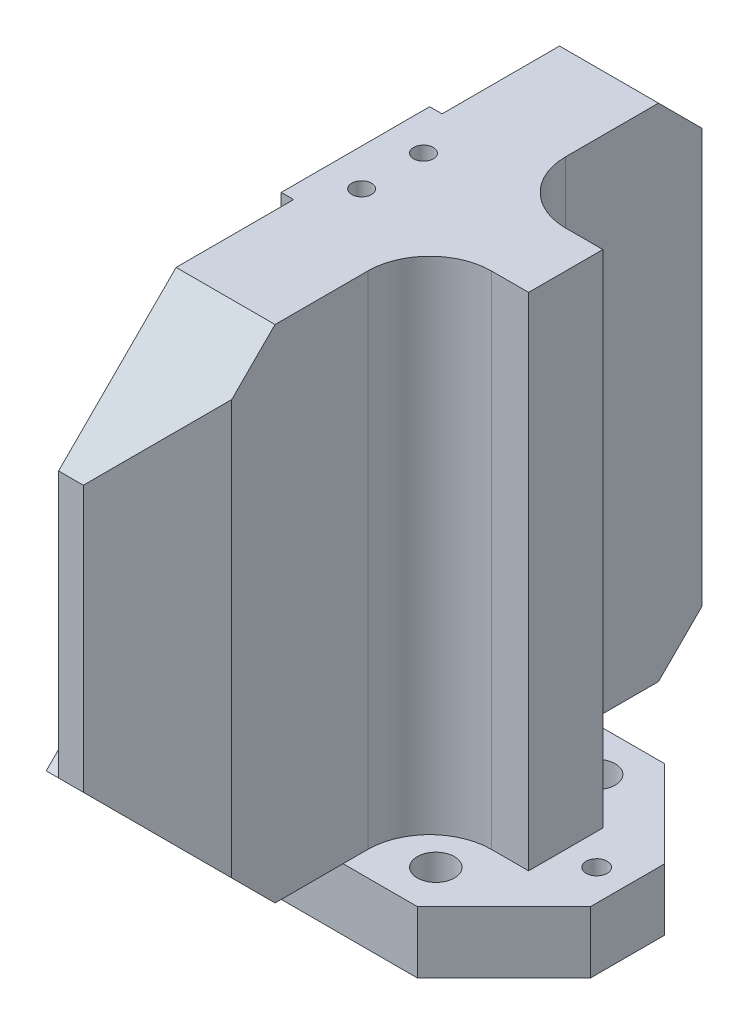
from build123d import *

# Parameters (mm, degrees)
SKETCH_1_W                  = 50
SKETCH_1_H                  = 40
EXTRUDE_1_DEPTH             = 8
CHAMFER_1_SIZE              = 9.5
SKETCH_2_W                  = 40
SKETCH_2_H                  = 20
EXTRUDE_2_DEPTH             = 5
SKETCH_3_W                  = 8
SKETCH_3_H                  = 6
EXTRUDE_3_DEPTH             = 40
FILLET_1_R                  = 5
CHAMFER_2_SIZE              = 8
EXTRUDE_4_DEPTH             = 1
SKETCH_5_W                  = 12
SKETCH_5_H                  = 7
EXTRUDE_5_DEPTH             = 1
FILLET_2_R                  = 10
CHAMFER_3_SIZE              = 6
SKETCH_6_R                  = 0.5
CUT_EXTRUDE_1_DEPTH         = 5
HOLE_WIZARD_M21_D           = 1.6
HOLE_WIZARD_M21_DEPTH       = 6
HOLE_WIZARD_M21_TIP         = 0.480688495
SKETCH_9_R                  = 0.5
CUT_EXTRUDE_2_DEPTH         = 5
HOLE_WIZARD_M22_D           = 1.6
HOLE_WIZARD_M22_DEPTH       = 6
HOLE_WIZARD_M22_CSINK_D     = 2.05
HOLE_WIZARD_M22_CSINK_ANGLE = 90
HOLE_WIZARD_M22_TIP         = 0.480688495
SKETCH_12_R                 = 0.5
CUT_EXTRUDE_3_DEPTH         = 5
HOLE_WIZARD_M23_D           = 1.6
HOLE_WIZARD_M23_DEPTH       = 6
HOLE_WIZARD_M23_CSINK_D     = 2.05
HOLE_WIZARD_M23_CSINK_ANGLE = 90
HOLE_WIZARD_M23_TIP         = 0.480688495
SKETCH_15_R                 = 9.863116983
CUT_EXTRUDE_4_DEPTH         = 2
SKETCH_16_R                 = 12.5
CUT_EXTRUDE_5_DEPTH         = 3
CHAMFER_4_SIZE              = 3
SKETCH_17_R                 = 0.85
CUT_EXTRUDE_6_DEPTH         = 52.77383384
SKETCH_18_R                 = 1.5
CUT_EXTRUDE_7_DEPTH         = 52.77383384
EXTRUDE_6_DEPTH             = 5
SKETCH_20_W                 = 6.646739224
SKETCH_20_H                 = 18.762407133
SKETCH_20_W_2               = 8.959731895
SKETCH_20_H_2               = 13.769202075
CUT_EXTRUDE_8_DEPTH         = 10
SKETCH_21_R                 = 25.12601308
CUT_EXTRUDE_9_DEPTH         = 0.34
CHAMFER_5_SIZE              = 7
SKETCH_22_R                 = 2
CUT_EXTRUDE_10_DEPTH        = 52.634602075
SKETCH_23_R                 = 0.8
EXTRUDE_7_DEPTH             = 0.5
CHAMFER_6_SIZE              = 9.5


with BuildPart() as part:
    # Sketch 1 → Extrude 1 (new body)
    with BuildSketch(Plane(origin=(0, 0, 0), x_dir=(0, 0, -1), z_dir=(1, 0, 0))):
        Rectangle(SKETCH_1_W, SKETCH_1_H)
    extrude(amount=EXTRUDE_1_DEPTH)

    # Chamfer 1
    chamfer_1_edges = [part.edges().sort_by_distance(p)[0] for p in [
        (4, -20, -25),
        (4, -20, 25),
    ]]
    chamfer(chamfer_1_edges, length=CHAMFER_1_SIZE)

    # Sketch 2 → Extrude 2 (add)
    with BuildSketch(Plane(origin=(0, -20, 0), x_dir=(-1, 0, 0), z_dir=(0, -1, 0))):
        with Locations((-5, 0)):
            Rectangle(SKETCH_2_W, SKETCH_2_H)
    extrude(amount=EXTRUDE_2_DEPTH)

    # Sketch 3 → Extrude 3 (add)
    with BuildSketch(Plane(origin=(0, -20, 0), x_dir=(1, 0, 0), z_dir=(0, 1, 0))):
        with Locations((12, 0)):
            Rectangle(SKETCH_3_W, SKETCH_3_H)
    extrude(amount=EXTRUDE_3_DEPTH)

    # Fillet 1
    fillet_1_edges = [part.edges().sort_by_distance(p)[0] for p in [
        (8, 0, 3),
        (8, 0, -3),
    ]]
    fillet(fillet_1_edges, radius=FILLET_1_R)

    # Chamfer 2
    chamfer_2_edges = [part.edges().sort_by_distance(p)[0] for p in [
        (25, -22.5, -10),
        (25, -22.5, 10),
        (-15, -22.5, 10),
        (-15, -22.5, -10),
    ]]
    chamfer(chamfer_2_edges, length=CHAMFER_2_SIZE)

    # Sketch 4 → Extrude 4 (add)
    with BuildSketch(Plane.ZY):
        Polygon((25, -10.5), (20.050252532, -5.550252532), (5.600505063, -20), (15.5, -20), align=None)
        Polygon((-25, -10.5), (-20.050252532, -5.550252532), (-5.600505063, -20), (-15.5, -20), align=None)
    extrude(amount=EXTRUDE_4_DEPTH)

    # Sketch 5 → Extrude 5 (add)
    with BuildSketch(Plane.ZY):
        with Locations((0, 16.5)):
            Rectangle(SKETCH_5_W, SKETCH_5_H)
    extrude(amount=EXTRUDE_5_DEPTH)

    # Fillet 2
    fillet_2_edges = [part.edges().sort_by_distance(p)[0] for p in [
        (-0.5, -20, -5.600505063),
        (-0.5, -20, 5.600505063),
    ]]
    fillet(fillet_2_edges, radius=FILLET_2_R)

    # Chamfer 3
    chamfer_3_edges = [part.edges().sort_by_distance(p)[0] for p in [
        (8, 4.75, 25),
        (8, 4.75, -25),
    ]]
    chamfer(chamfer_3_edges, length=CHAMFER_3_SIZE)

    # Sketch 6 → Cut-Extrude 1 (cut)
    with BuildSketch(Plane(origin=(0, 20, 0), x_dir=(1, 0, 0), z_dir=(0, 1, 0))):
        with Locations(Location((2, 2.5, 0), (0, 0, 270))):
            Circle(SKETCH_6_R)
        with Locations(Location((2, -2.5, 0), (0, 0, 90))):
            Circle(SKETCH_6_R)
    extrude(amount=-CUT_EXTRUDE_1_DEPTH, mode=Mode.SUBTRACT)

    # Hole Wizard M21
    with Locations(Plane(origin=(0, 20, 0), x_dir=(1, 0, 0), z_dir=(0, 1, 0))):
        with Locations((2, 2.5), (2, -2.5)):
            Hole(HOLE_WIZARD_M21_D / 2, depth=HOLE_WIZARD_M21_DEPTH)
            with Locations((0, 0, -(HOLE_WIZARD_M21_DEPTH + HOLE_WIZARD_M21_TIP / 2))):  # 118° drill point
                Cone(0, HOLE_WIZARD_M21_D / 2, HOLE_WIZARD_M21_TIP, mode=Mode.SUBTRACT)

    # Sketch 9 → Cut-Extrude 2 (cut)
    with BuildSketch(Plane(origin=(0, -17.75, -17.75), x_dir=(-1, 0, 0), z_dir=(0, -0.7071067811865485, -0.7071067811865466))):
        with Locations(Location((-2, 0.818019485, 0), (0, 0, 90))):
            Circle(SKETCH_9_R)
        with Locations(Location((-2, 5.818019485, 0), (0, 0, 90))):
            Circle(SKETCH_9_R)
    extrude(amount=-CUT_EXTRUDE_2_DEPTH, mode=Mode.SUBTRACT)

    # Hole Wizard M22
    with Locations(Plane(origin=(0, -17.75, -17.75), x_dir=(-1, 0, 0), z_dir=(0, -0.7071067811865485, -0.7071067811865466))):
        with Locations((-2, 0.818019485), (-2, 5.818019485)):
            CounterSinkHole(HOLE_WIZARD_M22_D / 2, HOLE_WIZARD_M22_CSINK_D / 2, depth=HOLE_WIZARD_M22_DEPTH, counter_sink_angle=HOLE_WIZARD_M22_CSINK_ANGLE)
            with Locations((0, 0, -(HOLE_WIZARD_M22_DEPTH + HOLE_WIZARD_M22_TIP / 2))):  # 118° drill point
                Cone(0, HOLE_WIZARD_M22_D / 2, HOLE_WIZARD_M22_TIP, mode=Mode.SUBTRACT)

    # Sketch 12 → Cut-Extrude 3 (cut)
    with BuildSketch(Plane(origin=(0, -17.75, 17.75), x_dir=(1, 0, 0), z_dir=(0, -0.7071067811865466, 0.7071067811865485))):
        with Locations(Location((2, 0.818019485, 0), (0, 0, 270))):
            Circle(SKETCH_12_R)
        with Locations(Location((2, 5.818019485, 0), (0, 0, 270))):
            Circle(SKETCH_12_R)
    extrude(amount=-CUT_EXTRUDE_3_DEPTH, mode=Mode.SUBTRACT)

    # Hole Wizard M23
    with Locations(Plane(origin=(0, -17.75, 17.75), x_dir=(1, 0, 0), z_dir=(0, -0.7071067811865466, 0.7071067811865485))):
        with Locations((2, 0.818019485), (2, 5.818019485)):
            CounterSinkHole(HOLE_WIZARD_M23_D / 2, HOLE_WIZARD_M23_CSINK_D / 2, depth=HOLE_WIZARD_M23_DEPTH, counter_sink_angle=HOLE_WIZARD_M23_CSINK_ANGLE)
            with Locations((0, 0, -(HOLE_WIZARD_M23_DEPTH + HOLE_WIZARD_M23_TIP / 2))):  # 118° drill point
                Cone(0, HOLE_WIZARD_M23_D / 2, HOLE_WIZARD_M23_TIP, mode=Mode.SUBTRACT)

    # Sketch 15 → Cut-Extrude 4 (cut)
    with BuildSketch(Plane(origin=(13.5, 0, 13.5), x_dir=(0.7071067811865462, 0, -0.7071067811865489), z_dir=(0.7071067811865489, 0, 0.7071067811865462))):
        with Locations((8.25638918, -22.918677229)):
            Circle(SKETCH_15_R)
    extrude(amount=-CUT_EXTRUDE_4_DEPTH, mode=Mode.SUBTRACT)

    # Sketch 16 → Cut-Extrude 5 (cut)
    with BuildSketch(Plane(origin=(13.5, 0, -13.5), x_dir=(-0.7071067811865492, 0, -0.7071067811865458), z_dir=(0.7071067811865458, 0, -0.7071067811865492))):
        with Locations((-10.482372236, -23.195890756)):
            Circle(SKETCH_16_R)
    extrude(amount=-CUT_EXTRUDE_5_DEPTH, mode=Mode.SUBTRACT)

    # Chamfer 4
    chamfer_4_edges = [part.edges().sort_by_distance(p)[0] for p in [
        (23.464466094, -22.5, 0.707106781),
    ]]
    chamfer(chamfer_4_edges, length=CHAMFER_4_SIZE)

    # Sketch 17 → Cut-Extrude 6 (cut, through all)
    with BuildSketch(Plane(origin=(0, -20, 0), x_dir=(1, 0, 0), z_dir=(0, 1, 0))):
        with Locations(Location((18.5, 0, 0), (0, 0, 270))):
            Circle(SKETCH_17_R)
    extrude(amount=-CUT_EXTRUDE_6_DEPTH, mode=Mode.SUBTRACT)

    # Sketch 18 → Cut-Extrude 7 (cut, through all)
    with BuildSketch(Plane(origin=(0, -20, 0), x_dir=(1, 0, 0), z_dir=(0, 1, 0))):
        with Locations(Location((12, 6.5, 0), (0, 0, 270))):
            Circle(SKETCH_18_R)
        with Locations(Location((12, -6.5, 0), (0, 0, 90))):
            Circle(SKETCH_18_R)
        with Locations(Location((-12, 0, 0), (0, 0, 270))):
            Circle(SKETCH_18_R)
    extrude(amount=-CUT_EXTRUDE_7_DEPTH, mode=Mode.SUBTRACT)

    # Sketch 19 → Extrude 6 (add)
    with BuildSketch(Plane(origin=(0, -20, 0), x_dir=(1, 0, 0), z_dir=(0, 1, 0))):
        Polygon((14.171572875, -10), (22.664533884, -10), (21.343145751, -2.828427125), align=None)
        Polygon((21.343145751, 1.414213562), (12.757359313, 10), (22.047893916, 10), align=None)
    extrude(amount=-EXTRUDE_6_DEPTH)

    # Sketch 20 → Cut-Extrude 8 (cut)
    with BuildSketch(Plane(origin=(0, -20, 0), x_dir=(1, 0, 0), z_dir=(0, 1, 0))):
        with Locations((24.666515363, -12.209630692)):
            Rectangle(SKETCH_20_W, SKETCH_20_H)
        with Locations((25.823011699, 8.298814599)):
            Rectangle(SKETCH_20_W_2, SKETCH_20_H_2)
    extrude(amount=-CUT_EXTRUDE_8_DEPTH, mode=Mode.SUBTRACT)

    # Sketch 21 → Cut-Extrude 9 (cut)
    with BuildSketch(Plane(origin=(21.343145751, 0, 0), x_dir=(0, 0, -1), z_dir=(1, 0, 0))):
        with Locations((0, -22.979232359)):
            Circle(SKETCH_21_R)
    extrude(amount=-CUT_EXTRUDE_9_DEPTH, mode=Mode.SUBTRACT)

    # Chamfer 5
    chamfer_5_edges = [part.edges().sort_by_distance(p)[0] for p in [
        (21.003145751, -22.5, 10),
        (21.003145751, -22.5, -10),
    ]]
    chamfer(chamfer_5_edges, length=CHAMFER_5_SIZE)

    # Sketch 22 → Cut-Extrude 10 (cut, through all)
    with BuildSketch(Plane(origin=(0, -20, 0), x_dir=(1, 0, 0), z_dir=(0, 1, 0))):
        with Locations(Location((-4, 0, 0), (0, 0, 270))):
            Circle(SKETCH_22_R)
    extrude(amount=-CUT_EXTRUDE_10_DEPTH, mode=Mode.SUBTRACT)

    # Sketch 23 → Extrude 7 (add)
    with BuildSketch(Plane(origin=(0, 20, 0), x_dir=(1, 0, 0), z_dir=(0, 1, 0))):
        with BuildLine():
            Line((13, 3), (16, 3))
            Line((16, 3), (16, -3))
            Line((16, -3), (13, -3))
            ThreePointArc((13, -3), (9.464466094, -4.464466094), (8, -8))
            Line((8, -8), (8, -19))
            Line((8, -19), (2, -25))
            Line((2, -25), (0, -25))
            Line((0, -25), (0, -6))
            Line((0, -6), (-1, -6))
            Line((-1, -6), (-1, 6))
            Line((-1, 6), (0, 6))
            Line((0, 6), (0, 25))
            Line((0, 25), (2, 25))
            Line((2, 25), (8, 19))
            Line((8, 19), (8, 8))
            ThreePointArc((8, 8), (9.464466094, 4.464466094), (13, 3))
        make_face()
        with Locations(Location((2, 2.5, 0), (0, 0, 270))):
            Circle(SKETCH_23_R, mode=Mode.SUBTRACT)
        with Locations(Location((2, -2.5, 0), (0, 0, 270))):
            Circle(SKETCH_23_R, mode=Mode.SUBTRACT)
    extrude(amount=EXTRUDE_7_DEPTH)

    # Chamfer 6
    chamfer_6_edges = [part.edges().sort_by_distance(p)[0] for p in [
        (1, 20.5, 25),
        (1, 20.5, -25),
    ]]
    chamfer(chamfer_6_edges, length=CHAMFER_6_SIZE)


solid = part.part
